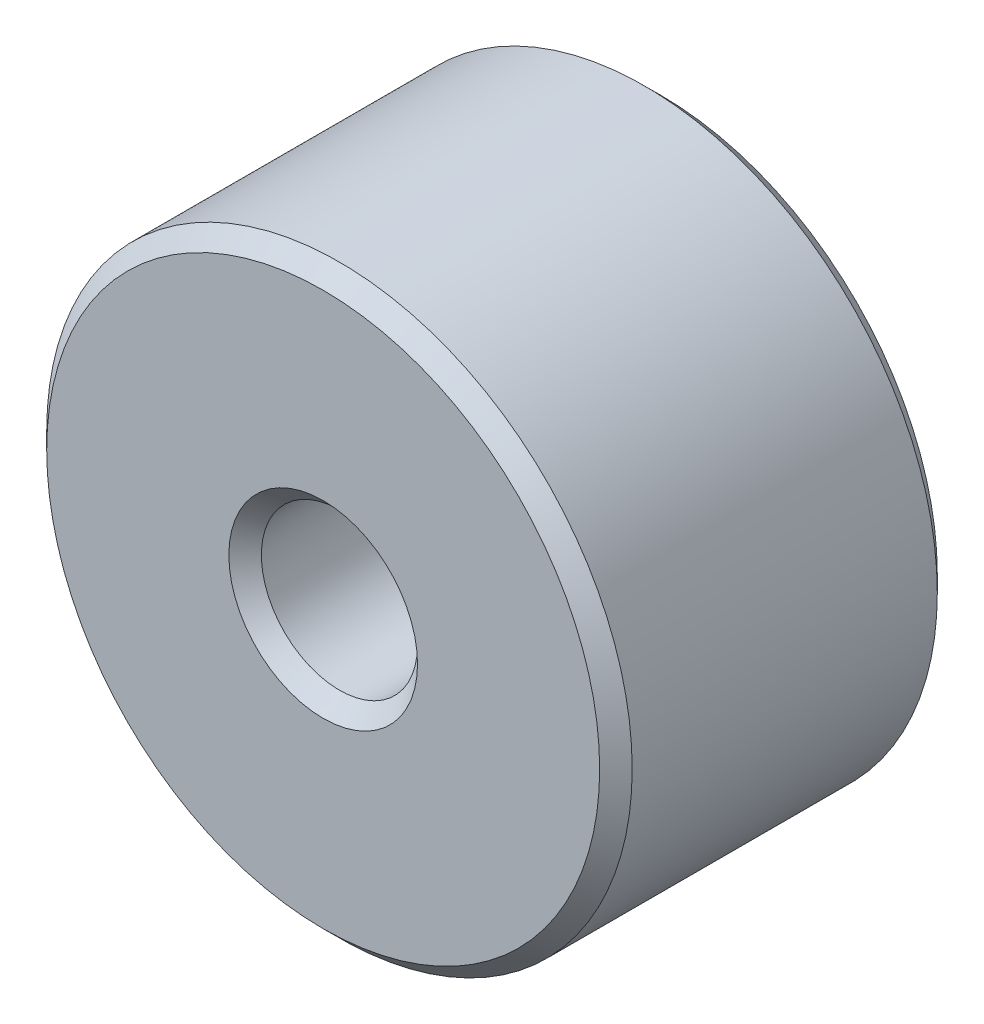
ISO-10303-21;
HEADER;
FILE_DESCRIPTION(('STEP AP214'),'2;1');
FILE_NAME('part.step','',(''),(''),'','','');
FILE_SCHEMA(('AUTOMOTIVE_DESIGN { 1 0 10303 214 1 1 1 1 }'));
ENDSEC;
DATA;
#1=APPLICATION_CONTEXT('core data for automotive mechanical design processes');
#2=APPLICATION_PROTOCOL_DEFINITION('international standard','automotive_design',2000,#1);
#3=PRODUCT_CONTEXT('',#1,'mechanical');
#4=PRODUCT('Part','Part','',(#3));
#5=PRODUCT_RELATED_PRODUCT_CATEGORY('part','',(#4));
#6=PRODUCT_DEFINITION_FORMATION('','',#4);
#7=PRODUCT_DEFINITION_CONTEXT('part definition',#1,'design');
#8=PRODUCT_DEFINITION('design','',#6,#7);
#9=PRODUCT_DEFINITION_SHAPE('','',#8);
#10=(LENGTH_UNIT() NAMED_UNIT(*) SI_UNIT(.MILLI.,.METRE.));
#11=(NAMED_UNIT(*) PLANE_ANGLE_UNIT() SI_UNIT($,.RADIAN.));
#12=(NAMED_UNIT(*) SI_UNIT($,.STERADIAN.) SOLID_ANGLE_UNIT());
#13=UNCERTAINTY_MEASURE_WITH_UNIT(LENGTH_MEASURE(1.E-05),#10,'distance_accuracy_value','');
#14=(GEOMETRIC_REPRESENTATION_CONTEXT(3) GLOBAL_UNCERTAINTY_ASSIGNED_CONTEXT((#13)) GLOBAL_UNIT_ASSIGNED_CONTEXT((#10,
#11,#12)) REPRESENTATION_CONTEXT('',''));
#15=CARTESIAN_POINT('',(0.,0.,0.));
#16=DIRECTION('',(0.,0.,1.));
#17=DIRECTION('',(1.,0.,0.));
#18=AXIS2_PLACEMENT_3D('',#15,#16,#17);
#19=CARTESIAN_POINT('',(0.,0.,5.19));
#20=DIRECTION('',(0.,0.,1.));
#21=DIRECTION('',(1.,0.,0.));
#22=AXIS2_PLACEMENT_3D('',#19,#20,#21);
#23=PLANE('',#22);
#24=CARTESIAN_POINT('',(0.,0.,5.19));
#25=DIRECTION('',(0.,0.,1.));
#26=DIRECTION('',(1.,0.,0.));
#27=AXIS2_PLACEMENT_3D('',#24,#25,#26);
#28=CIRCLE('',#27,8.5);
#29=CARTESIAN_POINT('',(8.5,0.,5.19));
#30=VERTEX_POINT('',#29);
#31=EDGE_CURVE('E10',#30,#30,#28,.T.);
#32=ORIENTED_EDGE('',*,*,#31,.T.);
#33=EDGE_LOOP('',(#32));
#34=FACE_BOUND('',#33,.T.);
#35=CARTESIAN_POINT('',(0.,0.,5.19));
#36=DIRECTION('',(0.,0.,1.));
#37=DIRECTION('',(1.,0.,0.));
#38=AXIS2_PLACEMENT_3D('',#35,#36,#37);
#39=CIRCLE('',#38,2.9);
#40=CARTESIAN_POINT('',(2.9,0.,5.19));
#41=VERTEX_POINT('',#40);
#42=EDGE_CURVE('E42',#41,#41,#39,.F.);
#43=ORIENTED_EDGE('',*,*,#42,.T.);
#44=EDGE_LOOP('',(#43));
#45=FACE_BOUND('',#44,.T.);
#46=ADVANCED_FACE('F34',(#34,#45),#23,.T.);
#47=CARTESIAN_POINT('',(0.,0.,-5.19));
#48=DIRECTION('',(0.,0.,1.));
#49=DIRECTION('',(1.,0.,0.));
#50=AXIS2_PLACEMENT_3D('',#47,#48,#49);
#51=PLANE('',#50);
#52=CARTESIAN_POINT('',(0.,0.,-5.19));
#53=DIRECTION('',(0.,0.,1.));
#54=DIRECTION('',(1.,0.,0.));
#55=AXIS2_PLACEMENT_3D('',#52,#53,#54);
#56=CIRCLE('',#55,2.9);
#57=CARTESIAN_POINT('',(2.9,0.,-5.19));
#58=VERTEX_POINT('',#57);
#59=EDGE_CURVE('E61',#58,#58,#56,.T.);
#60=ORIENTED_EDGE('',*,*,#59,.T.);
#61=EDGE_LOOP('',(#60));
#62=FACE_BOUND('',#61,.T.);
#63=CARTESIAN_POINT('',(0.,0.,-5.19));
#64=DIRECTION('',(0.,0.,1.));
#65=DIRECTION('',(1.,0.,0.));
#66=AXIS2_PLACEMENT_3D('',#63,#64,#65);
#67=CIRCLE('',#66,8.49999999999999);
#68=CARTESIAN_POINT('',(8.49999999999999,0.,-5.19));
#69=VERTEX_POINT('',#68);
#70=EDGE_CURVE('E64',#69,#69,#67,.F.);
#71=ORIENTED_EDGE('',*,*,#70,.T.);
#72=EDGE_LOOP('',(#71));
#73=FACE_BOUND('',#72,.T.);
#74=ADVANCED_FACE('F68',(#62,#73),#51,.F.);
#75=CARTESIAN_POINT('',(0.,0.,5.19));
#76=DIRECTION('',(0.,0.,-1.));
#77=DIRECTION('',(-1.,0.,0.));
#78=AXIS2_PLACEMENT_3D('',#75,#76,#77);
#79=CYLINDRICAL_SURFACE('',#78,9.);
#80=CARTESIAN_POINT('',(0.,0.,-4.69));
#81=DIRECTION('',(0.,0.,1.));
#82=DIRECTION('',(1.,0.,0.));
#83=AXIS2_PLACEMENT_3D('',#80,#81,#82);
#84=CIRCLE('',#83,9.);
#85=CARTESIAN_POINT('',(9.,0.,-4.69));
#86=VERTEX_POINT('',#85);
#87=EDGE_CURVE('E46',#86,#86,#84,.T.);
#88=ORIENTED_EDGE('',*,*,#87,.T.);
#89=EDGE_LOOP('',(#88));
#90=FACE_BOUND('',#89,.T.);
#91=CARTESIAN_POINT('',(0.,0.,4.69));
#92=DIRECTION('',(0.,0.,1.));
#93=DIRECTION('',(1.,0.,0.));
#94=AXIS2_PLACEMENT_3D('',#91,#92,#93);
#95=CIRCLE('',#94,9.);
#96=CARTESIAN_POINT('',(9.,0.,4.69));
#97=VERTEX_POINT('',#96);
#98=EDGE_CURVE('E50',#97,#97,#95,.F.);
#99=ORIENTED_EDGE('',*,*,#98,.T.);
#100=EDGE_LOOP('',(#99));
#101=FACE_BOUND('',#100,.T.);
#102=ADVANCED_FACE('F78',(#90,#101),#79,.T.);
#103=CARTESIAN_POINT('',(0.,0.,5.19));
#104=DIRECTION('',(0.,0.,-1.));
#105=DIRECTION('',(-1.,0.,0.));
#106=AXIS2_PLACEMENT_3D('',#103,#104,#105);
#107=CYLINDRICAL_SURFACE('',#106,2.4);
#108=CARTESIAN_POINT('',(0.,0.,-4.68999999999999));
#109=DIRECTION('',(0.,0.,1.));
#110=DIRECTION('',(1.,0.,0.));
#111=AXIS2_PLACEMENT_3D('',#108,#109,#110);
#112=CIRCLE('',#111,2.4);
#113=CARTESIAN_POINT('',(2.4,0.,-4.68999999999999));
#114=VERTEX_POINT('',#113);
#115=EDGE_CURVE('E55',#114,#114,#112,.F.);
#116=ORIENTED_EDGE('',*,*,#115,.T.);
#117=EDGE_LOOP('',(#116));
#118=FACE_BOUND('',#117,.T.);
#119=CARTESIAN_POINT('',(0.,0.,4.69));
#120=DIRECTION('',(0.,0.,1.));
#121=DIRECTION('',(1.,0.,0.));
#122=AXIS2_PLACEMENT_3D('',#119,#120,#121);
#123=CIRCLE('',#122,2.4);
#124=CARTESIAN_POINT('',(2.4,0.,4.69));
#125=VERTEX_POINT('',#124);
#126=EDGE_CURVE('E58',#125,#125,#123,.T.);
#127=ORIENTED_EDGE('',*,*,#126,.T.);
#128=EDGE_LOOP('',(#127));
#129=FACE_BOUND('',#128,.T.);
#130=ADVANCED_FACE('F81',(#118,#129),#107,.F.);
#131=CARTESIAN_POINT('',(0.,0.,-5.19));
#132=DIRECTION('',(0.,0.,-1.));
#133=DIRECTION('',(-1.,0.,0.));
#134=AXIS2_PLACEMENT_3D('',#131,#132,#133);
#135=CONICAL_SURFACE('',#134,2.9,0.785398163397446);
#136=ORIENTED_EDGE('',*,*,#115,.F.);
#137=EDGE_LOOP('',(#136));
#138=FACE_BOUND('',#137,.T.);
#139=ORIENTED_EDGE('',*,*,#59,.F.);
#140=EDGE_LOOP('',(#139));
#141=FACE_BOUND('',#140,.T.);
#142=ADVANCED_FACE('F74',(#138,#141),#135,.F.);
#143=CARTESIAN_POINT('',(0.,0.,-4.69));
#144=DIRECTION('',(0.,0.,1.));
#145=DIRECTION('',(1.,0.,0.));
#146=AXIS2_PLACEMENT_3D('',#143,#144,#145);
#147=CONICAL_SURFACE('',#146,9.,0.785398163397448);
#148=ORIENTED_EDGE('',*,*,#70,.F.);
#149=EDGE_LOOP('',(#148));
#150=FACE_BOUND('',#149,.T.);
#151=ORIENTED_EDGE('',*,*,#87,.F.);
#152=EDGE_LOOP('',(#151));
#153=FACE_BOUND('',#152,.T.);
#154=ADVANCED_FACE('F70',(#150,#153),#147,.T.);
#155=CARTESIAN_POINT('',(0.,0.,5.19));
#156=DIRECTION('',(0.,0.,-1.));
#157=DIRECTION('',(-1.,0.,0.));
#158=AXIS2_PLACEMENT_3D('',#155,#156,#157);
#159=CONICAL_SURFACE('',#158,8.5,0.785398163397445);
#160=ORIENTED_EDGE('',*,*,#98,.F.);
#161=EDGE_LOOP('',(#160));
#162=FACE_BOUND('',#161,.T.);
#163=ORIENTED_EDGE('',*,*,#31,.F.);
#164=EDGE_LOOP('',(#163));
#165=FACE_BOUND('',#164,.T.);
#166=ADVANCED_FACE('F73',(#162,#165),#159,.T.);
#167=CARTESIAN_POINT('',(0.,0.,4.69));
#168=DIRECTION('',(0.,0.,1.));
#169=DIRECTION('',(1.,0.,0.));
#170=AXIS2_PLACEMENT_3D('',#167,#168,#169);
#171=CONICAL_SURFACE('',#170,2.4,0.785398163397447);
#172=ORIENTED_EDGE('',*,*,#42,.F.);
#173=EDGE_LOOP('',(#172));
#174=FACE_BOUND('',#173,.T.);
#175=ORIENTED_EDGE('',*,*,#126,.F.);
#176=EDGE_LOOP('',(#175));
#177=FACE_BOUND('',#176,.T.);
#178=ADVANCED_FACE('F37',(#174,#177),#171,.F.);
#179=CLOSED_SHELL('',(#46,#74,#102,#130,#142,#154,#166,#178));
#180=MANIFOLD_SOLID_BREP('B2',#179);
#181=ADVANCED_BREP_SHAPE_REPRESENTATION('',(#18,#180),#14);
#182=SHAPE_DEFINITION_REPRESENTATION(#9,#181);
ENDSEC;
END-ISO-10303-21;
